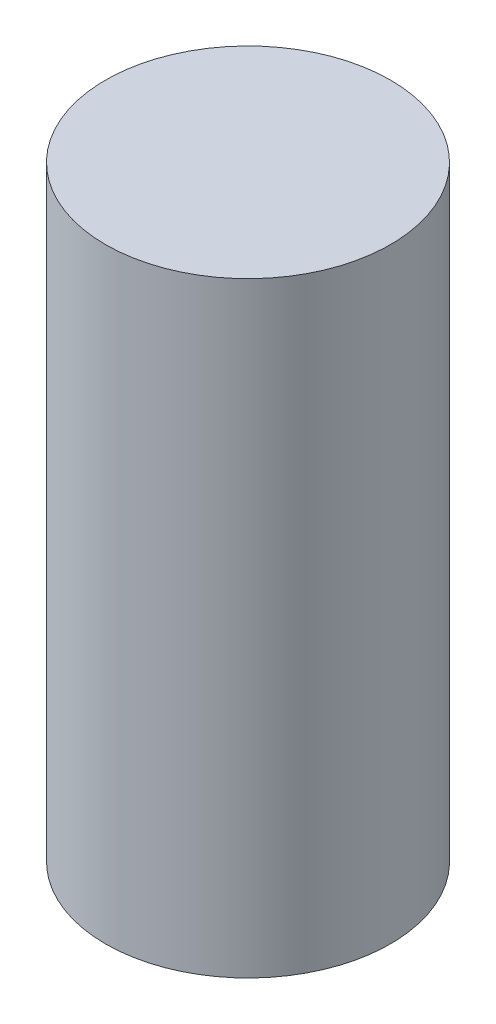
ISO-10303-21;
HEADER;
FILE_DESCRIPTION(('STEP AP214'),'2;1');
FILE_NAME('part.step','',(''),(''),'','','');
FILE_SCHEMA(('AUTOMOTIVE_DESIGN { 1 0 10303 214 1 1 1 1 }'));
ENDSEC;
DATA;
#1=APPLICATION_CONTEXT('core data for automotive mechanical design processes');
#2=APPLICATION_PROTOCOL_DEFINITION('international standard','automotive_design',2000,#1);
#3=PRODUCT_CONTEXT('',#1,'mechanical');
#4=PRODUCT('Part','Part','',(#3));
#5=PRODUCT_RELATED_PRODUCT_CATEGORY('part','',(#4));
#6=PRODUCT_DEFINITION_FORMATION('','',#4);
#7=PRODUCT_DEFINITION_CONTEXT('part definition',#1,'design');
#8=PRODUCT_DEFINITION('design','',#6,#7);
#9=PRODUCT_DEFINITION_SHAPE('','',#8);
#10=(LENGTH_UNIT() NAMED_UNIT(*) SI_UNIT(.MILLI.,.METRE.));
#11=(NAMED_UNIT(*) PLANE_ANGLE_UNIT() SI_UNIT($,.RADIAN.));
#12=(NAMED_UNIT(*) SI_UNIT($,.STERADIAN.) SOLID_ANGLE_UNIT());
#13=UNCERTAINTY_MEASURE_WITH_UNIT(LENGTH_MEASURE(1.E-05),#10,'distance_accuracy_value','');
#14=(GEOMETRIC_REPRESENTATION_CONTEXT(3) GLOBAL_UNCERTAINTY_ASSIGNED_CONTEXT((#13)) GLOBAL_UNIT_ASSIGNED_CONTEXT((#10,
#11,#12)) REPRESENTATION_CONTEXT('',''));
#15=CARTESIAN_POINT('',(0.,0.,0.));
#16=DIRECTION('',(0.,0.,1.));
#17=DIRECTION('',(1.,0.,0.));
#18=AXIS2_PLACEMENT_3D('',#15,#16,#17);
#19=CARTESIAN_POINT('',(0.,85.,0.));
#20=DIRECTION('',(0.,-1.,0.));
#21=DIRECTION('',(0.,0.,-1.));
#22=AXIS2_PLACEMENT_3D('',#19,#20,#21);
#23=CYLINDRICAL_SURFACE('',#22,20.);
#24=CARTESIAN_POINT('',(0.,85.,0.));
#25=DIRECTION('',(0.,1.,0.));
#26=DIRECTION('',(0.,0.,1.));
#27=AXIS2_PLACEMENT_3D('',#24,#25,#26);
#28=CIRCLE('',#27,20.);
#29=CARTESIAN_POINT('',(0.,85.,20.));
#30=VERTEX_POINT('',#29);
#31=EDGE_CURVE('E10',#30,#30,#28,.T.);
#32=ORIENTED_EDGE('',*,*,#31,.F.);
#33=EDGE_LOOP('',(#32));
#34=FACE_BOUND('',#33,.T.);
#35=CARTESIAN_POINT('',(0.,0.,0.));
#36=DIRECTION('',(0.,1.,0.));
#37=DIRECTION('',(0.,0.,1.));
#38=AXIS2_PLACEMENT_3D('',#35,#36,#37);
#39=CIRCLE('',#38,20.);
#40=CARTESIAN_POINT('',(0.,0.,20.));
#41=VERTEX_POINT('',#40);
#42=EDGE_CURVE('E42',#41,#41,#39,.T.);
#43=ORIENTED_EDGE('',*,*,#42,.T.);
#44=EDGE_LOOP('',(#43));
#45=FACE_BOUND('',#44,.T.);
#46=ADVANCED_FACE('F39',(#34,#45),#23,.T.);
#47=CARTESIAN_POINT('',(0.,85.,0.));
#48=DIRECTION('',(0.,1.,0.));
#49=DIRECTION('',(0.,0.,1.));
#50=AXIS2_PLACEMENT_3D('',#47,#48,#49);
#51=PLANE('',#50);
#52=ORIENTED_EDGE('',*,*,#31,.T.);
#53=EDGE_LOOP('',(#52));
#54=FACE_BOUND('',#53,.T.);
#55=ADVANCED_FACE('F54',(#54),#51,.T.);
#56=CARTESIAN_POINT('',(0.,0.,0.));
#57=DIRECTION('',(0.,1.,0.));
#58=DIRECTION('',(0.,0.,1.));
#59=AXIS2_PLACEMENT_3D('',#56,#57,#58);
#60=PLANE('',#59);
#61=ORIENTED_EDGE('',*,*,#42,.F.);
#62=EDGE_LOOP('',(#61));
#63=FACE_BOUND('',#62,.T.);
#64=ADVANCED_FACE('F52',(#63),#60,.F.);
#65=CLOSED_SHELL('',(#46,#55,#64));
#66=MANIFOLD_SOLID_BREP('B2',#65);
#67=ADVANCED_BREP_SHAPE_REPRESENTATION('',(#18,#66),#14);
#68=SHAPE_DEFINITION_REPRESENTATION(#9,#67);
ENDSEC;
END-ISO-10303-21;
